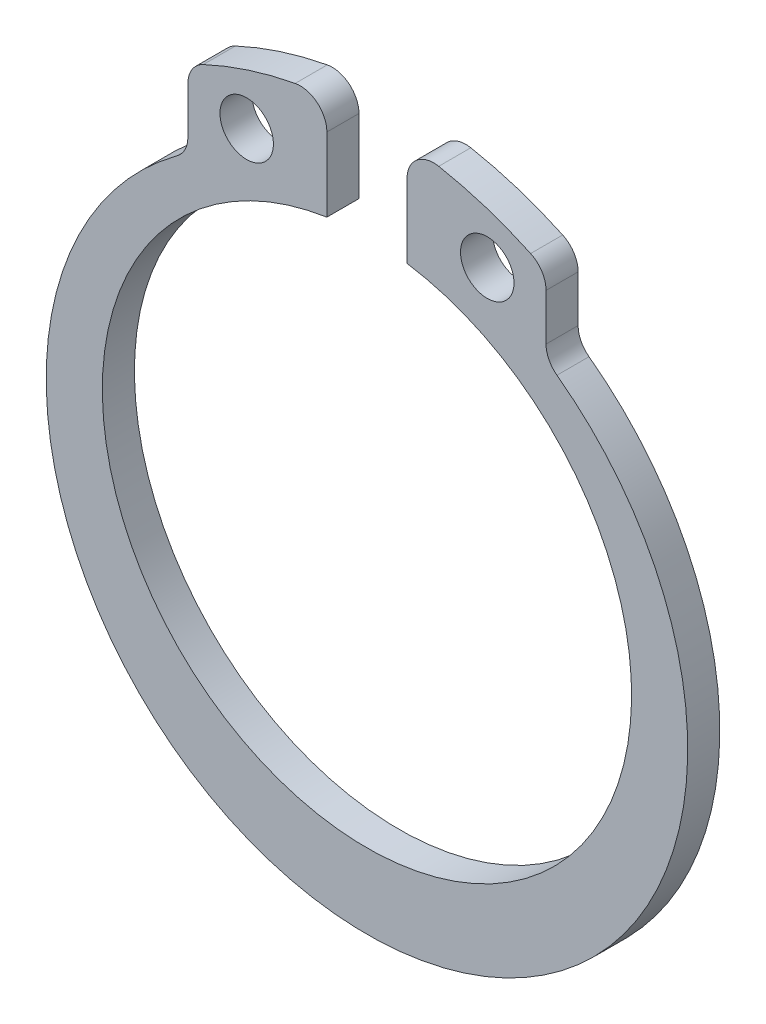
ISO-10303-21;
HEADER;
FILE_DESCRIPTION(('STEP AP214'),'2;1');
FILE_NAME('part.step','',(''),(''),'','','');
FILE_SCHEMA(('AUTOMOTIVE_DESIGN { 1 0 10303 214 1 1 1 1 }'));
ENDSEC;
DATA;
#1=APPLICATION_CONTEXT('core data for automotive mechanical design processes');
#2=APPLICATION_PROTOCOL_DEFINITION('international standard','automotive_design',2000,#1);
#3=PRODUCT_CONTEXT('',#1,'mechanical');
#4=PRODUCT('Part','Part','',(#3));
#5=PRODUCT_RELATED_PRODUCT_CATEGORY('part','',(#4));
#6=PRODUCT_DEFINITION_FORMATION('','',#4);
#7=PRODUCT_DEFINITION_CONTEXT('part definition',#1,'design');
#8=PRODUCT_DEFINITION('design','',#6,#7);
#9=PRODUCT_DEFINITION_SHAPE('','',#8);
#10=(LENGTH_UNIT() NAMED_UNIT(*) SI_UNIT(.MILLI.,.METRE.));
#11=(NAMED_UNIT(*) PLANE_ANGLE_UNIT() SI_UNIT($,.RADIAN.));
#12=(NAMED_UNIT(*) SI_UNIT($,.STERADIAN.) SOLID_ANGLE_UNIT());
#13=UNCERTAINTY_MEASURE_WITH_UNIT(LENGTH_MEASURE(1.E-05),#10,'distance_accuracy_value','');
#14=(GEOMETRIC_REPRESENTATION_CONTEXT(3) GLOBAL_UNCERTAINTY_ASSIGNED_CONTEXT((#13)) GLOBAL_UNIT_ASSIGNED_CONTEXT((#10,
#11,#12)) REPRESENTATION_CONTEXT('',''));
#15=CARTESIAN_POINT('',(0.,0.,0.));
#16=DIRECTION('',(0.,0.,1.));
#17=DIRECTION('',(1.,0.,0.));
#18=AXIS2_PLACEMENT_3D('',#15,#16,#17);
#19=CARTESIAN_POINT('',(0.,0.5766463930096,0.));
#20=DIRECTION('',(0.,0.,1.));
#21=DIRECTION('',(1.,0.,0.));
#22=AXIS2_PLACEMENT_3D('',#19,#20,#21);
#23=PLANE('',#22);
#24=CARTESIAN_POINT('',(4.5,10.5452156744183,0.));
#25=DIRECTION('',(0.,0.,1.));
#26=DIRECTION('',(1.,0.,0.));
#27=AXIS2_PLACEMENT_3D('',#24,#25,#26);
#28=CIRCLE('',#27,1.);
#29=CARTESIAN_POINT('',(5.5,10.5452156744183,0.));
#30=VERTEX_POINT('',#29);
#31=EDGE_CURVE('E186',#30,#30,#28,.T.);
#32=ORIENTED_EDGE('',*,*,#31,.T.);
#33=EDGE_LOOP('',(#32));
#34=FACE_BOUND('',#33,.T.);
#35=CARTESIAN_POINT('',(-4.5,10.5452156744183,0.));
#36=DIRECTION('',(0.,0.,1.));
#37=DIRECTION('',(1.,0.,0.));
#38=AXIS2_PLACEMENT_3D('',#35,#36,#37);
#39=CIRCLE('',#38,1.);
#40=CARTESIAN_POINT('',(-3.5,10.5452156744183,0.));
#41=VERTEX_POINT('',#40);
#42=EDGE_CURVE('E189',#41,#41,#39,.T.);
#43=ORIENTED_EDGE('',*,*,#42,.T.);
#44=EDGE_LOOP('',(#43));
#45=FACE_BOUND('',#44,.T.);
#46=CARTESIAN_POINT('',(0.,-0.607189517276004,0.));
#47=DIRECTION('',(0.,0.,1.));
#48=DIRECTION('',(1.,0.,0.));
#49=AXIS2_PLACEMENT_3D('',#46,#47,#48);
#50=CIRCLE('',#49,9.9);
#51=CARTESIAN_POINT('',(-1.5,9.17851434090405,0.));
#52=VERTEX_POINT('',#51);
#53=CARTESIAN_POINT('',(1.5,9.17851434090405,0.));
#54=VERTEX_POINT('',#53);
#55=EDGE_CURVE('E20',#52,#54,#50,.T.);
#56=ORIENTED_EDGE('',*,*,#55,.T.);
#57=DIRECTION('',(0.,1.,0.));
#58=VECTOR('',#57,1.);
#59=CARTESIAN_POINT('',(1.5,9.17851434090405,0.));
#60=LINE('',#59,#58);
#61=CARTESIAN_POINT('',(1.5,11.9368344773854,0.));
#62=VERTEX_POINT('',#61);
#63=EDGE_CURVE('E141',#62,#54,#60,.F.);
#64=ORIENTED_EDGE('',*,*,#63,.F.);
#65=CARTESIAN_POINT('',(2.5,11.9368344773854,0.));
#66=DIRECTION('',(0.,0.,1.));
#67=DIRECTION('',(1.,0.,0.));
#68=AXIS2_PLACEMENT_3D('',#65,#66,#67);
#69=CIRCLE('',#68,1.);
#70=CARTESIAN_POINT('',(2.68548864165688,12.9194808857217,0.));
#71=VERTEX_POINT('',#70);
#72=EDGE_CURVE('E192',#71,#62,#69,.T.);
#73=ORIENTED_EDGE('',*,*,#72,.F.);
#74=CARTESIAN_POINT('',(0.,-1.30718951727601,0.));
#75=DIRECTION('',(0.,0.,1.));
#76=DIRECTION('',(1.,0.,0.));
#77=AXIS2_PLACEMENT_3D('',#74,#75,#76);
#78=CIRCLE('',#77,14.4779142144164);
#79=CARTESIAN_POINT('',(6.12291410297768,11.8122587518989,0.));
#80=VERTEX_POINT('',#79);
#81=EDGE_CURVE('E195',#80,#71,#78,.T.);
#82=ORIENTED_EDGE('',*,*,#81,.F.);
#83=CARTESIAN_POINT('',(5.69999999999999,10.9060889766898,0.));
#84=DIRECTION('',(0.,0.,1.));
#85=DIRECTION('',(1.,0.,0.));
#86=AXIS2_PLACEMENT_3D('',#83,#84,#85);
#87=CIRCLE('',#86,1.00000000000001);
#88=CARTESIAN_POINT('',(6.7,10.9060889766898,0.));
#89=VERTEX_POINT('',#88);
#90=EDGE_CURVE('E198',#89,#80,#87,.T.);
#91=ORIENTED_EDGE('',*,*,#90,.F.);
#92=DIRECTION('',(0.,1.,0.));
#93=VECTOR('',#92,1.);
#94=CARTESIAN_POINT('',(6.7,10.9060889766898,0.));
#95=LINE('',#94,#93);
#96=CARTESIAN_POINT('',(6.7,9.16706463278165,0.));
#97=VERTEX_POINT('',#96);
#98=EDGE_CURVE('E143',#97,#89,#95,.T.);
#99=ORIENTED_EDGE('',*,*,#98,.F.);
#100=CARTESIAN_POINT('',(7.70000000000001,9.16706463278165,0.));
#101=DIRECTION('',(0.,0.,1.));
#102=DIRECTION('',(1.,0.,0.));
#103=AXIS2_PLACEMENT_3D('',#100,#101,#102);
#104=CIRCLE('',#103,1.00000000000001);
#105=CARTESIAN_POINT('',(7.10769230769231,8.3613527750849,0.));
#106=VERTEX_POINT('',#105);
#107=EDGE_CURVE('E200',#97,#106,#104,.T.);
#108=ORIENTED_EDGE('',*,*,#107,.T.);
#109=CARTESIAN_POINT('',(0.,-1.30718951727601,0.));
#110=DIRECTION('',(0.,0.,1.));
#111=DIRECTION('',(1.,0.,0.));
#112=AXIS2_PLACEMENT_3D('',#109,#110,#111);
#113=CIRCLE('',#112,12.);
#114=CARTESIAN_POINT('',(-7.10769230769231,8.3613527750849,0.));
#115=VERTEX_POINT('',#114);
#116=EDGE_CURVE('E203',#115,#106,#113,.T.);
#117=ORIENTED_EDGE('',*,*,#116,.F.);
#118=CARTESIAN_POINT('',(-7.7,9.16706463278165,0.));
#119=DIRECTION('',(0.,0.,1.));
#120=DIRECTION('',(1.,0.,0.));
#121=AXIS2_PLACEMENT_3D('',#118,#119,#120);
#122=CIRCLE('',#121,1.);
#123=CARTESIAN_POINT('',(-6.7,9.16706463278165,0.));
#124=VERTEX_POINT('',#123);
#125=EDGE_CURVE('E149',#115,#124,#122,.T.);
#126=ORIENTED_EDGE('',*,*,#125,.T.);
#127=DIRECTION('',(0.,1.,0.));
#128=VECTOR('',#127,1.);
#129=CARTESIAN_POINT('',(-6.7,9.16706463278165,0.));
#130=LINE('',#129,#128);
#131=CARTESIAN_POINT('',(-6.7,10.9060889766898,0.));
#132=VERTEX_POINT('',#131);
#133=EDGE_CURVE('E147',#132,#124,#130,.F.);
#134=ORIENTED_EDGE('',*,*,#133,.F.);
#135=CARTESIAN_POINT('',(-5.7,10.9060889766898,0.));
#136=DIRECTION('',(0.,0.,1.));
#137=DIRECTION('',(1.,0.,0.));
#138=AXIS2_PLACEMENT_3D('',#135,#136,#137);
#139=CIRCLE('',#138,1.00000000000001);
#140=CARTESIAN_POINT('',(-6.12291410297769,11.8122587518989,0.));
#141=VERTEX_POINT('',#140);
#142=EDGE_CURVE('E209',#141,#132,#139,.T.);
#143=ORIENTED_EDGE('',*,*,#142,.F.);
#144=CARTESIAN_POINT('',(0.,-1.30718951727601,0.));
#145=DIRECTION('',(0.,0.,1.));
#146=DIRECTION('',(1.,0.,0.));
#147=AXIS2_PLACEMENT_3D('',#144,#145,#146);
#148=CIRCLE('',#147,14.4779142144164);
#149=CARTESIAN_POINT('',(-2.68548864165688,12.9194808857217,0.));
#150=VERTEX_POINT('',#149);
#151=EDGE_CURVE('E212',#150,#141,#148,.T.);
#152=ORIENTED_EDGE('',*,*,#151,.F.);
#153=CARTESIAN_POINT('',(-2.5,11.9368344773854,0.));
#154=DIRECTION('',(0.,0.,1.));
#155=DIRECTION('',(1.,0.,0.));
#156=AXIS2_PLACEMENT_3D('',#153,#154,#155);
#157=CIRCLE('',#156,1.);
#158=CARTESIAN_POINT('',(-1.5,11.9368344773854,0.));
#159=VERTEX_POINT('',#158);
#160=EDGE_CURVE('E128',#159,#150,#157,.T.);
#161=ORIENTED_EDGE('',*,*,#160,.F.);
#162=DIRECTION('',(0.,1.,0.));
#163=VECTOR('',#162,1.);
#164=CARTESIAN_POINT('',(-1.5,11.9368344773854,0.));
#165=LINE('',#164,#163);
#166=EDGE_CURVE('E126',#52,#159,#165,.T.);
#167=ORIENTED_EDGE('',*,*,#166,.F.);
#168=EDGE_LOOP('',(#56,#64,#73,#82,#91,#99,#108,#117,#126,#134,#143,#152,#161,#167));
#169=FACE_BOUND('',#168,.T.);
#170=ADVANCED_FACE('F17',(#34,#45,#169),#23,.F.);
#171=CARTESIAN_POINT('',(0.,-0.607189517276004,0.));
#172=DIRECTION('',(0.,0.,1.));
#173=DIRECTION('',(1.,0.,0.));
#174=AXIS2_PLACEMENT_3D('',#171,#172,#173);
#175=CYLINDRICAL_SURFACE('',#174,9.9);
#176=DIRECTION('',(0.,0.,1.));
#177=VECTOR('',#176,1.);
#178=CARTESIAN_POINT('',(1.5,9.17851434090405,0.));
#179=LINE('',#178,#177);
#180=CARTESIAN_POINT('',(1.5,9.17851434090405,1.2));
#181=VERTEX_POINT('',#180);
#182=EDGE_CURVE('E121',#54,#181,#179,.T.);
#183=ORIENTED_EDGE('',*,*,#182,.F.);
#184=ORIENTED_EDGE('',*,*,#55,.F.);
#185=DIRECTION('',(0.,0.,-1.));
#186=VECTOR('',#185,1.);
#187=CARTESIAN_POINT('',(-1.5,9.17851434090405,0.));
#188=LINE('',#187,#186);
#189=CARTESIAN_POINT('',(-1.5,9.17851434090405,1.2));
#190=VERTEX_POINT('',#189);
#191=EDGE_CURVE('E118',#190,#52,#188,.T.);
#192=ORIENTED_EDGE('',*,*,#191,.F.);
#193=CARTESIAN_POINT('',(0.,-0.607189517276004,1.2));
#194=DIRECTION('',(0.,0.,1.));
#195=DIRECTION('',(1.,0.,0.));
#196=AXIS2_PLACEMENT_3D('',#193,#194,#195);
#197=CIRCLE('',#196,9.9);
#198=EDGE_CURVE('E184',#181,#190,#197,.F.);
#199=ORIENTED_EDGE('',*,*,#198,.F.);
#200=EDGE_LOOP('',(#183,#184,#192,#199));
#201=FACE_BOUND('',#200,.T.);
#202=ADVANCED_FACE('F116',(#201),#175,.F.);
#203=CARTESIAN_POINT('',(-1.5,11.9368344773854,0.));
#204=DIRECTION('',(1.,0.,0.));
#205=DIRECTION('',(0.,0.,-1.));
#206=AXIS2_PLACEMENT_3D('',#203,#204,#205);
#207=PLANE('',#206);
#208=ORIENTED_EDGE('',*,*,#166,.T.);
#209=DIRECTION('',(0.,0.,1.));
#210=VECTOR('',#209,1.);
#211=CARTESIAN_POINT('',(-1.5,11.9368344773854,0.));
#212=LINE('',#211,#210);
#213=CARTESIAN_POINT('',(-1.5,11.9368344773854,1.2));
#214=VERTEX_POINT('',#213);
#215=EDGE_CURVE('E131',#214,#159,#212,.F.);
#216=ORIENTED_EDGE('',*,*,#215,.F.);
#217=DIRECTION('',(0.,1.,0.));
#218=VECTOR('',#217,1.);
#219=CARTESIAN_POINT('',(-1.5,0.5766463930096,1.2));
#220=LINE('',#219,#218);
#221=EDGE_CURVE('E135',#190,#214,#220,.T.);
#222=ORIENTED_EDGE('',*,*,#221,.F.);
#223=ORIENTED_EDGE('',*,*,#191,.T.);
#224=EDGE_LOOP('',(#208,#216,#222,#223));
#225=FACE_BOUND('',#224,.T.);
#226=ADVANCED_FACE('F133',(#225),#207,.T.);
#227=CARTESIAN_POINT('',(-2.5,11.9368344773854,0.));
#228=DIRECTION('',(0.,0.,1.));
#229=DIRECTION('',(1.,0.,0.));
#230=AXIS2_PLACEMENT_3D('',#227,#228,#229);
#231=CYLINDRICAL_SURFACE('',#230,1.);
#232=ORIENTED_EDGE('',*,*,#160,.T.);
#233=DIRECTION('',(0.,0.,1.));
#234=VECTOR('',#233,1.);
#235=CARTESIAN_POINT('',(-2.68548864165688,12.9194808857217,0.));
#236=LINE('',#235,#234);
#237=CARTESIAN_POINT('',(-2.68548864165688,12.9194808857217,1.2));
#238=VERTEX_POINT('',#237);
#239=EDGE_CURVE('E213',#238,#150,#236,.F.);
#240=ORIENTED_EDGE('',*,*,#239,.F.);
#241=CARTESIAN_POINT('',(-2.5,11.9368344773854,1.2));
#242=DIRECTION('',(0.,0.,1.));
#243=DIRECTION('',(1.,0.,0.));
#244=AXIS2_PLACEMENT_3D('',#241,#242,#243);
#245=CIRCLE('',#244,1.);
#246=EDGE_CURVE('E181',#214,#238,#245,.T.);
#247=ORIENTED_EDGE('',*,*,#246,.F.);
#248=ORIENTED_EDGE('',*,*,#215,.T.);
#249=EDGE_LOOP('',(#232,#240,#247,#248));
#250=FACE_BOUND('',#249,.T.);
#251=ADVANCED_FACE('F217',(#250),#231,.T.);
#252=CARTESIAN_POINT('',(0.,-1.30718951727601,0.));
#253=DIRECTION('',(0.,0.,1.));
#254=DIRECTION('',(1.,0.,0.));
#255=AXIS2_PLACEMENT_3D('',#252,#253,#254);
#256=CYLINDRICAL_SURFACE('',#255,14.4779142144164);
#257=ORIENTED_EDGE('',*,*,#151,.T.);
#258=DIRECTION('',(0.,0.,1.));
#259=VECTOR('',#258,1.);
#260=CARTESIAN_POINT('',(-6.12291410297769,11.8122587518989,0.));
#261=LINE('',#260,#259);
#262=CARTESIAN_POINT('',(-6.12291410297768,11.8122587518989,1.2));
#263=VERTEX_POINT('',#262);
#264=EDGE_CURVE('E211',#263,#141,#261,.F.);
#265=ORIENTED_EDGE('',*,*,#264,.F.);
#266=CARTESIAN_POINT('',(0.,-1.30718951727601,1.2));
#267=DIRECTION('',(0.,0.,1.));
#268=DIRECTION('',(1.,0.,0.));
#269=AXIS2_PLACEMENT_3D('',#266,#267,#268);
#270=CIRCLE('',#269,14.4779142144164);
#271=EDGE_CURVE('E178',#238,#263,#270,.T.);
#272=ORIENTED_EDGE('',*,*,#271,.F.);
#273=ORIENTED_EDGE('',*,*,#239,.T.);
#274=EDGE_LOOP('',(#257,#265,#272,#273));
#275=FACE_BOUND('',#274,.T.);
#276=ADVANCED_FACE('F249',(#275),#256,.T.);
#277=CARTESIAN_POINT('',(-5.7,10.9060889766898,0.));
#278=DIRECTION('',(0.,0.,1.));
#279=DIRECTION('',(1.,0.,0.));
#280=AXIS2_PLACEMENT_3D('',#277,#278,#279);
#281=CYLINDRICAL_SURFACE('',#280,1.00000000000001);
#282=ORIENTED_EDGE('',*,*,#142,.T.);
#283=DIRECTION('',(0.,0.,1.));
#284=VECTOR('',#283,1.);
#285=CARTESIAN_POINT('',(-6.7,10.9060889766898,0.));
#286=LINE('',#285,#284);
#287=CARTESIAN_POINT('',(-6.7,10.9060889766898,1.2));
#288=VERTEX_POINT('',#287);
#289=EDGE_CURVE('E150',#288,#132,#286,.F.);
#290=ORIENTED_EDGE('',*,*,#289,.F.);
#291=CARTESIAN_POINT('',(-5.7,10.9060889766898,1.2));
#292=DIRECTION('',(0.,0.,1.));
#293=DIRECTION('',(1.,0.,0.));
#294=AXIS2_PLACEMENT_3D('',#291,#292,#293);
#295=CIRCLE('',#294,1.00000000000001);
#296=EDGE_CURVE('E175',#263,#288,#295,.T.);
#297=ORIENTED_EDGE('',*,*,#296,.F.);
#298=ORIENTED_EDGE('',*,*,#264,.T.);
#299=EDGE_LOOP('',(#282,#290,#297,#298));
#300=FACE_BOUND('',#299,.T.);
#301=ADVANCED_FACE('F245',(#300),#281,.T.);
#302=CARTESIAN_POINT('',(-6.7,9.16706463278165,0.));
#303=DIRECTION('',(-1.,0.,0.));
#304=DIRECTION('',(0.,0.,1.));
#305=AXIS2_PLACEMENT_3D('',#302,#303,#304);
#306=PLANE('',#305);
#307=ORIENTED_EDGE('',*,*,#133,.T.);
#308=DIRECTION('',(0.,0.,1.));
#309=VECTOR('',#308,1.);
#310=CARTESIAN_POINT('',(-6.7,9.16706463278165,0.));
#311=LINE('',#310,#309);
#312=CARTESIAN_POINT('',(-6.7,9.16706463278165,1.2));
#313=VERTEX_POINT('',#312);
#314=EDGE_CURVE('E208',#124,#313,#311,.T.);
#315=ORIENTED_EDGE('',*,*,#314,.T.);
#316=DIRECTION('',(0.,1.,0.));
#317=VECTOR('',#316,1.);
#318=CARTESIAN_POINT('',(-6.70000000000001,0.5766463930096,1.2));
#319=LINE('',#318,#317);
#320=EDGE_CURVE('E174',#288,#313,#319,.F.);
#321=ORIENTED_EDGE('',*,*,#320,.F.);
#322=ORIENTED_EDGE('',*,*,#289,.T.);
#323=EDGE_LOOP('',(#307,#315,#321,#322));
#324=FACE_BOUND('',#323,.T.);
#325=ADVANCED_FACE('F254',(#324),#306,.T.);
#326=CARTESIAN_POINT('',(-7.7,9.16706463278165,0.));
#327=DIRECTION('',(0.,0.,1.));
#328=DIRECTION('',(1.,0.,0.));
#329=AXIS2_PLACEMENT_3D('',#326,#327,#328);
#330=CYLINDRICAL_SURFACE('',#329,1.);
#331=ORIENTED_EDGE('',*,*,#314,.F.);
#332=ORIENTED_EDGE('',*,*,#125,.F.);
#333=DIRECTION('',(0.,0.,1.));
#334=VECTOR('',#333,1.);
#335=CARTESIAN_POINT('',(-7.10769230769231,8.36135277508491,0.));
#336=LINE('',#335,#334);
#337=CARTESIAN_POINT('',(-7.10769230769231,8.36135277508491,1.2));
#338=VERTEX_POINT('',#337);
#339=EDGE_CURVE('E206',#338,#115,#336,.F.);
#340=ORIENTED_EDGE('',*,*,#339,.F.);
#341=CARTESIAN_POINT('',(-7.7,9.16706463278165,1.2));
#342=DIRECTION('',(0.,0.,1.));
#343=DIRECTION('',(1.,0.,0.));
#344=AXIS2_PLACEMENT_3D('',#341,#342,#343);
#345=CIRCLE('',#344,1.);
#346=EDGE_CURVE('E171',#313,#338,#345,.F.);
#347=ORIENTED_EDGE('',*,*,#346,.F.);
#348=EDGE_LOOP('',(#331,#332,#340,#347));
#349=FACE_BOUND('',#348,.T.);
#350=ADVANCED_FACE('F259',(#349),#330,.F.);
#351=CARTESIAN_POINT('',(0.,-1.30718951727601,0.));
#352=DIRECTION('',(0.,0.,1.));
#353=DIRECTION('',(1.,0.,0.));
#354=AXIS2_PLACEMENT_3D('',#351,#352,#353);
#355=CYLINDRICAL_SURFACE('',#354,12.);
#356=ORIENTED_EDGE('',*,*,#116,.T.);
#357=DIRECTION('',(0.,0.,1.));
#358=VECTOR('',#357,1.);
#359=CARTESIAN_POINT('',(7.1076923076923,8.36135277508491,0.));
#360=LINE('',#359,#358);
#361=CARTESIAN_POINT('',(7.10769230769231,8.3613527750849,1.2));
#362=VERTEX_POINT('',#361);
#363=EDGE_CURVE('E202',#106,#362,#360,.T.);
#364=ORIENTED_EDGE('',*,*,#363,.T.);
#365=CARTESIAN_POINT('',(0.,-1.30718951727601,1.2));
#366=DIRECTION('',(0.,0.,1.));
#367=DIRECTION('',(1.,0.,0.));
#368=AXIS2_PLACEMENT_3D('',#365,#366,#367);
#369=CIRCLE('',#368,12.);
#370=EDGE_CURVE('E168',#338,#362,#369,.T.);
#371=ORIENTED_EDGE('',*,*,#370,.F.);
#372=ORIENTED_EDGE('',*,*,#339,.T.);
#373=EDGE_LOOP('',(#356,#364,#371,#372));
#374=FACE_BOUND('',#373,.T.);
#375=ADVANCED_FACE('F261',(#374),#355,.T.);
#376=CARTESIAN_POINT('',(7.70000000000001,9.16706463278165,0.));
#377=DIRECTION('',(0.,0.,1.));
#378=DIRECTION('',(1.,0.,0.));
#379=AXIS2_PLACEMENT_3D('',#376,#377,#378);
#380=CYLINDRICAL_SURFACE('',#379,1.00000000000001);
#381=ORIENTED_EDGE('',*,*,#363,.F.);
#382=ORIENTED_EDGE('',*,*,#107,.F.);
#383=DIRECTION('',(0.,0.,-1.));
#384=VECTOR('',#383,1.);
#385=CARTESIAN_POINT('',(6.7,9.16706463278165,0.));
#386=LINE('',#385,#384);
#387=CARTESIAN_POINT('',(6.7,9.16706463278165,1.2));
#388=VERTEX_POINT('',#387);
#389=EDGE_CURVE('E146',#388,#97,#386,.T.);
#390=ORIENTED_EDGE('',*,*,#389,.F.);
#391=CARTESIAN_POINT('',(7.70000000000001,9.16706463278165,1.2));
#392=DIRECTION('',(0.,0.,1.));
#393=DIRECTION('',(1.,0.,0.));
#394=AXIS2_PLACEMENT_3D('',#391,#392,#393);
#395=CIRCLE('',#394,1.00000000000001);
#396=EDGE_CURVE('E165',#362,#388,#395,.F.);
#397=ORIENTED_EDGE('',*,*,#396,.F.);
#398=EDGE_LOOP('',(#381,#382,#390,#397));
#399=FACE_BOUND('',#398,.T.);
#400=ADVANCED_FACE('F265',(#399),#380,.F.);
#401=CARTESIAN_POINT('',(6.7,10.9060889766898,0.));
#402=DIRECTION('',(1.,0.,0.));
#403=DIRECTION('',(0.,0.,-1.));
#404=AXIS2_PLACEMENT_3D('',#401,#402,#403);
#405=PLANE('',#404);
#406=ORIENTED_EDGE('',*,*,#98,.T.);
#407=DIRECTION('',(0.,0.,1.));
#408=VECTOR('',#407,1.);
#409=CARTESIAN_POINT('',(6.7,10.9060889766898,0.));
#410=LINE('',#409,#408);
#411=CARTESIAN_POINT('',(6.7,10.9060889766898,1.2));
#412=VERTEX_POINT('',#411);
#413=EDGE_CURVE('E145',#412,#89,#410,.F.);
#414=ORIENTED_EDGE('',*,*,#413,.F.);
#415=DIRECTION('',(0.,1.,0.));
#416=VECTOR('',#415,1.);
#417=CARTESIAN_POINT('',(6.7,0.5766463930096,1.2));
#418=LINE('',#417,#416);
#419=EDGE_CURVE('E164',#388,#412,#418,.T.);
#420=ORIENTED_EDGE('',*,*,#419,.F.);
#421=ORIENTED_EDGE('',*,*,#389,.T.);
#422=EDGE_LOOP('',(#406,#414,#420,#421));
#423=FACE_BOUND('',#422,.T.);
#424=ADVANCED_FACE('F283',(#423),#405,.T.);
#425=CARTESIAN_POINT('',(5.69999999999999,10.9060889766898,0.));
#426=DIRECTION('',(0.,0.,1.));
#427=DIRECTION('',(1.,0.,0.));
#428=AXIS2_PLACEMENT_3D('',#425,#426,#427);
#429=CYLINDRICAL_SURFACE('',#428,1.00000000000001);
#430=ORIENTED_EDGE('',*,*,#90,.T.);
#431=DIRECTION('',(0.,0.,1.));
#432=VECTOR('',#431,1.);
#433=CARTESIAN_POINT('',(6.12291410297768,11.8122587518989,0.));
#434=LINE('',#433,#432);
#435=CARTESIAN_POINT('',(6.12291410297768,11.8122587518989,1.2));
#436=VERTEX_POINT('',#435);
#437=EDGE_CURVE('E197',#436,#80,#434,.F.);
#438=ORIENTED_EDGE('',*,*,#437,.F.);
#439=CARTESIAN_POINT('',(5.69999999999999,10.9060889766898,1.2));
#440=DIRECTION('',(0.,0.,1.));
#441=DIRECTION('',(1.,0.,0.));
#442=AXIS2_PLACEMENT_3D('',#439,#440,#441);
#443=CIRCLE('',#442,1.00000000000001);
#444=EDGE_CURVE('E161',#412,#436,#443,.T.);
#445=ORIENTED_EDGE('',*,*,#444,.F.);
#446=ORIENTED_EDGE('',*,*,#413,.T.);
#447=EDGE_LOOP('',(#430,#438,#445,#446));
#448=FACE_BOUND('',#447,.T.);
#449=ADVANCED_FACE('F281',(#448),#429,.T.);
#450=CARTESIAN_POINT('',(0.,-1.30718951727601,0.));
#451=DIRECTION('',(0.,0.,1.));
#452=DIRECTION('',(1.,0.,0.));
#453=AXIS2_PLACEMENT_3D('',#450,#451,#452);
#454=CYLINDRICAL_SURFACE('',#453,14.4779142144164);
#455=ORIENTED_EDGE('',*,*,#81,.T.);
#456=DIRECTION('',(0.,0.,1.));
#457=VECTOR('',#456,1.);
#458=CARTESIAN_POINT('',(2.68548864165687,12.9194808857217,0.));
#459=LINE('',#458,#457);
#460=CARTESIAN_POINT('',(2.68548864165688,12.9194808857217,1.2));
#461=VERTEX_POINT('',#460);
#462=EDGE_CURVE('E194',#461,#71,#459,.F.);
#463=ORIENTED_EDGE('',*,*,#462,.F.);
#464=CARTESIAN_POINT('',(0.,-1.30718951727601,1.2));
#465=DIRECTION('',(0.,0.,1.));
#466=DIRECTION('',(1.,0.,0.));
#467=AXIS2_PLACEMENT_3D('',#464,#465,#466);
#468=CIRCLE('',#467,14.4779142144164);
#469=EDGE_CURVE('E158',#436,#461,#468,.T.);
#470=ORIENTED_EDGE('',*,*,#469,.F.);
#471=ORIENTED_EDGE('',*,*,#437,.T.);
#472=EDGE_LOOP('',(#455,#463,#470,#471));
#473=FACE_BOUND('',#472,.T.);
#474=ADVANCED_FACE('F279',(#473),#454,.T.);
#475=CARTESIAN_POINT('',(2.5,11.9368344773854,0.));
#476=DIRECTION('',(0.,0.,1.));
#477=DIRECTION('',(1.,0.,0.));
#478=AXIS2_PLACEMENT_3D('',#475,#476,#477);
#479=CYLINDRICAL_SURFACE('',#478,1.);
#480=ORIENTED_EDGE('',*,*,#72,.T.);
#481=DIRECTION('',(0.,0.,1.));
#482=VECTOR('',#481,1.);
#483=CARTESIAN_POINT('',(1.5,11.9368344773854,0.));
#484=LINE('',#483,#482);
#485=CARTESIAN_POINT('',(1.5,11.9368344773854,1.2));
#486=VERTEX_POINT('',#485);
#487=EDGE_CURVE('E35',#486,#62,#484,.F.);
#488=ORIENTED_EDGE('',*,*,#487,.F.);
#489=CARTESIAN_POINT('',(2.5,11.9368344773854,1.2));
#490=DIRECTION('',(0.,0.,1.));
#491=DIRECTION('',(1.,0.,0.));
#492=AXIS2_PLACEMENT_3D('',#489,#490,#491);
#493=CIRCLE('',#492,1.);
#494=EDGE_CURVE('E155',#461,#486,#493,.T.);
#495=ORIENTED_EDGE('',*,*,#494,.F.);
#496=ORIENTED_EDGE('',*,*,#462,.T.);
#497=EDGE_LOOP('',(#480,#488,#495,#496));
#498=FACE_BOUND('',#497,.T.);
#499=ADVANCED_FACE('F276',(#498),#479,.T.);
#500=CARTESIAN_POINT('',(1.5,9.17851434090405,0.));
#501=DIRECTION('',(-1.,0.,0.));
#502=DIRECTION('',(0.,0.,1.));
#503=AXIS2_PLACEMENT_3D('',#500,#501,#502);
#504=PLANE('',#503);
#505=ORIENTED_EDGE('',*,*,#63,.T.);
#506=ORIENTED_EDGE('',*,*,#182,.T.);
#507=DIRECTION('',(0.,1.,0.));
#508=VECTOR('',#507,1.);
#509=CARTESIAN_POINT('',(1.5,0.5766463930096,1.2));
#510=LINE('',#509,#508);
#511=EDGE_CURVE('E154',#486,#181,#510,.F.);
#512=ORIENTED_EDGE('',*,*,#511,.F.);
#513=ORIENTED_EDGE('',*,*,#487,.T.);
#514=EDGE_LOOP('',(#505,#506,#512,#513));
#515=FACE_BOUND('',#514,.T.);
#516=ADVANCED_FACE('F272',(#515),#504,.T.);
#517=CARTESIAN_POINT('',(-4.5,10.5452156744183,0.));
#518=DIRECTION('',(0.,0.,1.));
#519=DIRECTION('',(1.,0.,0.));
#520=AXIS2_PLACEMENT_3D('',#517,#518,#519);
#521=CYLINDRICAL_SURFACE('',#520,1.);
#522=ORIENTED_EDGE('',*,*,#42,.F.);
#523=EDGE_LOOP('',(#522));
#524=FACE_BOUND('',#523,.T.);
#525=CARTESIAN_POINT('',(-4.5,10.5452156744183,1.2));
#526=DIRECTION('',(0.,0.,1.));
#527=DIRECTION('',(1.,0.,0.));
#528=AXIS2_PLACEMENT_3D('',#525,#526,#527);
#529=CIRCLE('',#528,1.);
#530=CARTESIAN_POINT('',(-3.5,10.5452156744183,1.2));
#531=VERTEX_POINT('',#530);
#532=EDGE_CURVE('E26',#531,#531,#529,.F.);
#533=ORIENTED_EDGE('',*,*,#532,.F.);
#534=EDGE_LOOP('',(#533));
#535=FACE_BOUND('',#534,.T.);
#536=ADVANCED_FACE('F300',(#524,#535),#521,.F.);
#537=CARTESIAN_POINT('',(4.5,10.5452156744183,0.));
#538=DIRECTION('',(0.,0.,1.));
#539=DIRECTION('',(1.,0.,0.));
#540=AXIS2_PLACEMENT_3D('',#537,#538,#539);
#541=CYLINDRICAL_SURFACE('',#540,1.);
#542=ORIENTED_EDGE('',*,*,#31,.F.);
#543=EDGE_LOOP('',(#542));
#544=FACE_BOUND('',#543,.T.);
#545=CARTESIAN_POINT('',(4.5,10.5452156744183,1.2));
#546=DIRECTION('',(0.,0.,1.));
#547=DIRECTION('',(1.,0.,0.));
#548=AXIS2_PLACEMENT_3D('',#545,#546,#547);
#549=CIRCLE('',#548,1.);
#550=CARTESIAN_POINT('',(5.5,10.5452156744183,1.2));
#551=VERTEX_POINT('',#550);
#552=EDGE_CURVE('E11',#551,#551,#549,.F.);
#553=ORIENTED_EDGE('',*,*,#552,.F.);
#554=EDGE_LOOP('',(#553));
#555=FACE_BOUND('',#554,.T.);
#556=ADVANCED_FACE('F294',(#544,#555),#541,.F.);
#557=CARTESIAN_POINT('',(0.,0.5766463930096,1.2));
#558=DIRECTION('',(0.,0.,1.));
#559=DIRECTION('',(1.,0.,0.));
#560=AXIS2_PLACEMENT_3D('',#557,#558,#559);
#561=PLANE('',#560);
#562=ORIENTED_EDGE('',*,*,#552,.T.);
#563=EDGE_LOOP('',(#562));
#564=FACE_BOUND('',#563,.T.);
#565=ORIENTED_EDGE('',*,*,#532,.T.);
#566=EDGE_LOOP('',(#565));
#567=FACE_BOUND('',#566,.T.);
#568=ORIENTED_EDGE('',*,*,#494,.T.);
#569=ORIENTED_EDGE('',*,*,#511,.T.);
#570=ORIENTED_EDGE('',*,*,#198,.T.);
#571=ORIENTED_EDGE('',*,*,#221,.T.);
#572=ORIENTED_EDGE('',*,*,#246,.T.);
#573=ORIENTED_EDGE('',*,*,#271,.T.);
#574=ORIENTED_EDGE('',*,*,#296,.T.);
#575=ORIENTED_EDGE('',*,*,#320,.T.);
#576=ORIENTED_EDGE('',*,*,#346,.T.);
#577=ORIENTED_EDGE('',*,*,#370,.T.);
#578=ORIENTED_EDGE('',*,*,#396,.T.);
#579=ORIENTED_EDGE('',*,*,#419,.T.);
#580=ORIENTED_EDGE('',*,*,#444,.T.);
#581=ORIENTED_EDGE('',*,*,#469,.T.);
#582=EDGE_LOOP('',(#568,#569,#570,#571,#572,#573,#574,#575,#576,#577,#578,#579,#580,#581));
#583=FACE_BOUND('',#582,.T.);
#584=ADVANCED_FACE('F220',(#564,#567,#583),#561,.T.);
#585=CLOSED_SHELL('',(#170,#202,#226,#251,#276,#301,#325,#350,#375,#400,#424,#449,#474,#499,
#516,#536,#556,#584));
#586=MANIFOLD_SOLID_BREP('B1',#585);
#587=ADVANCED_BREP_SHAPE_REPRESENTATION('',(#18,#586),#14);
#588=SHAPE_DEFINITION_REPRESENTATION(#9,#587);
ENDSEC;
END-ISO-10303-21;
